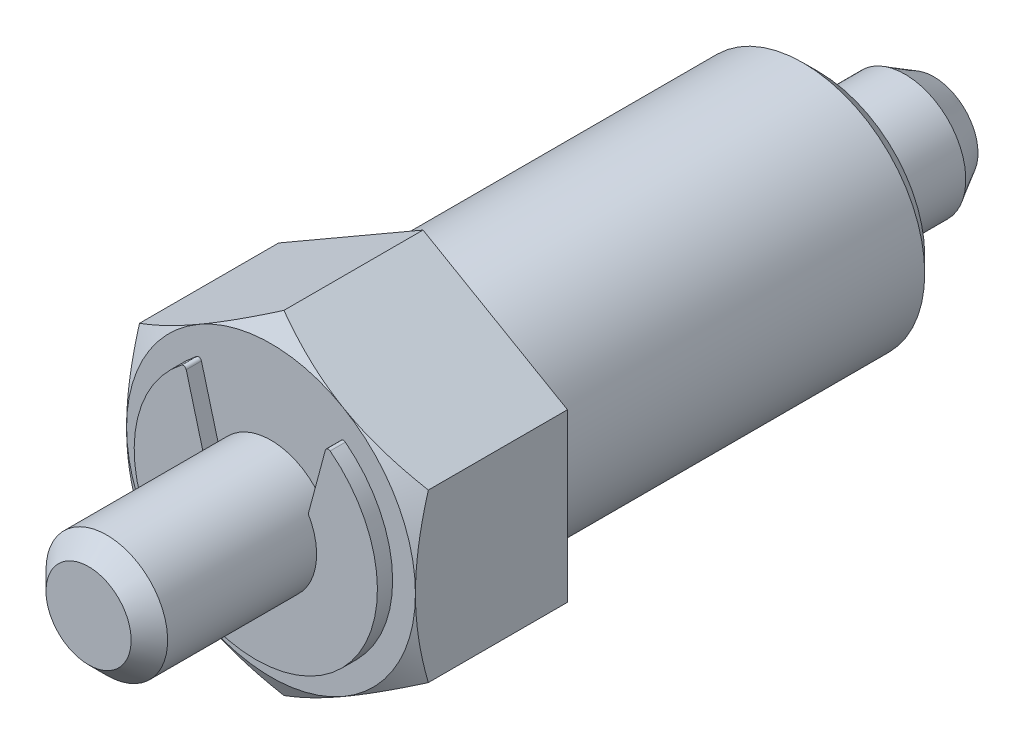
ISO-10303-21;
HEADER;
FILE_DESCRIPTION(('STEP AP214'),'2;1');
FILE_NAME('part.step','',(''),(''),'','','');
FILE_SCHEMA(('AUTOMOTIVE_DESIGN { 1 0 10303 214 1 1 1 1 }'));
ENDSEC;
DATA;
#1=APPLICATION_CONTEXT('core data for automotive mechanical design processes');
#2=APPLICATION_PROTOCOL_DEFINITION('international standard','automotive_design',2000,#1);
#3=PRODUCT_CONTEXT('',#1,'mechanical');
#4=PRODUCT('Part','Part','',(#3));
#5=PRODUCT_RELATED_PRODUCT_CATEGORY('part','',(#4));
#6=PRODUCT_DEFINITION_FORMATION('','',#4);
#7=PRODUCT_DEFINITION_CONTEXT('part definition',#1,'design');
#8=PRODUCT_DEFINITION('design','',#6,#7);
#9=PRODUCT_DEFINITION_SHAPE('','',#8);
#10=(LENGTH_UNIT() NAMED_UNIT(*) SI_UNIT(.MILLI.,.METRE.));
#11=(NAMED_UNIT(*) PLANE_ANGLE_UNIT() SI_UNIT($,.RADIAN.));
#12=(NAMED_UNIT(*) SI_UNIT($,.STERADIAN.) SOLID_ANGLE_UNIT());
#13=UNCERTAINTY_MEASURE_WITH_UNIT(LENGTH_MEASURE(1.E-05),#10,'distance_accuracy_value','');
#14=(GEOMETRIC_REPRESENTATION_CONTEXT(3) GLOBAL_UNCERTAINTY_ASSIGNED_CONTEXT((#13)) GLOBAL_UNIT_ASSIGNED_CONTEXT((#10,
#11,#12)) REPRESENTATION_CONTEXT('',''));
#15=CARTESIAN_POINT('',(0.,0.,0.));
#16=DIRECTION('',(0.,0.,1.));
#17=DIRECTION('',(1.,0.,0.));
#18=AXIS2_PLACEMENT_3D('',#15,#16,#17);
#19=CARTESIAN_POINT('',(-9.61399999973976,-9.69764665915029,10.0000000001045));
#20=DIRECTION('',(2.60239962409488E-11,-1.50249913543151E-11,1.));
#21=DIRECTION('',(1.,0.,-2.60239962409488E-11));
#22=AXIS2_PLACEMENT_3D('',#19,#20,#21);
#23=PLANE('',#22);
#24=CARTESIAN_POINT('',(2.60263999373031E-10,-1.50268686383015E-10,10.));
#25=DIRECTION('',(2.60239962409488E-11,-1.50249913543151E-11,1.));
#26=DIRECTION('',(1.,0.,-2.60239962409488E-11));
#27=AXIS2_PLACEMENT_3D('',#24,#25,#26);
#28=CIRCLE('',#27,9.50000539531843);
#29=CARTESIAN_POINT('',(9.50000269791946,-7.79397935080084E-08,10.0000015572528));
#30=VERTEX_POINT('',#29);
#31=CARTESIAN_POINT('',(4.75000121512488,8.22724374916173,10.000001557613));
#32=VERTEX_POINT('',#31);
#33=EDGE_CURVE('E621',#30,#32,#28,.T.);
#34=ORIENTED_EDGE('',*,*,#33,.T.);
#35=CARTESIAN_POINT('',(2.60263999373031E-10,-1.50268686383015E-10,10.));
#36=DIRECTION('',(2.60239962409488E-11,-1.50249913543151E-11,1.));
#37=DIRECTION('',(1.,0.,-2.60239962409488E-11));
#38=AXIS2_PLACEMENT_3D('',#35,#36,#37);
#39=CIRCLE('',#38,9.50000539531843);
#40=CARTESIAN_POINT('',(-4.75000147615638,8.22724359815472,10.0000015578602));
#41=VERTEX_POINT('',#40);
#42=EDGE_CURVE('E113',#32,#41,#39,.T.);
#43=ORIENTED_EDGE('',*,*,#42,.T.);
#44=CARTESIAN_POINT('',(2.60263999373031E-10,-1.50268686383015E-10,10.));
#45=DIRECTION('',(2.60239962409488E-11,-1.50249913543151E-11,1.));
#46=DIRECTION('',(1.,0.,-2.60239962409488E-11));
#47=AXIS2_PLACEMENT_3D('',#44,#45,#46);
#48=CIRCLE('',#47,9.50000539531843);
#49=CARTESIAN_POINT('',(-9.50000269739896,-3.97797905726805E-08,10.0000015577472));
#50=VERTEX_POINT('',#49);
#51=EDGE_CURVE('E97',#41,#50,#48,.T.);
#52=ORIENTED_EDGE('',*,*,#51,.T.);
#53=CARTESIAN_POINT('',(2.60263999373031E-10,-1.50268686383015E-10,10.));
#54=DIRECTION('',(2.60239962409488E-11,-1.50249913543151E-11,1.));
#55=DIRECTION('',(1.,0.,-2.60239962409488E-11));
#56=AXIS2_PLACEMENT_3D('',#53,#54,#55);
#57=CIRCLE('',#56,9.50000539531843);
#58=CARTESIAN_POINT('',(-4.7500012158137,-8.22724374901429,10.000001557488));
#59=VERTEX_POINT('',#58);
#60=EDGE_CURVE('E102',#50,#59,#57,.T.);
#61=ORIENTED_EDGE('',*,*,#60,.T.);
#62=CARTESIAN_POINT('',(2.60263999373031E-10,-1.50268686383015E-10,10.));
#63=DIRECTION('',(2.60239962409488E-11,-1.50249913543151E-11,1.));
#64=DIRECTION('',(1.,0.,-2.60239962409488E-11));
#65=AXIS2_PLACEMENT_3D('',#62,#63,#64);
#66=CIRCLE('',#65,9.50000539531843);
#67=CARTESIAN_POINT('',(4.75000147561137,-8.2272435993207,10.0000015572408));
#68=VERTEX_POINT('',#67);
#69=EDGE_CURVE('E107',#59,#68,#66,.T.);
#70=ORIENTED_EDGE('',*,*,#69,.T.);
#71=CARTESIAN_POINT('',(2.60263999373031E-10,-1.50268686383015E-10,10.));
#72=DIRECTION('',(2.60239962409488E-11,-1.50249913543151E-11,1.));
#73=DIRECTION('',(1.,0.,-2.60239962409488E-11));
#74=AXIS2_PLACEMENT_3D('',#71,#72,#73);
#75=CIRCLE('',#74,9.50000539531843);
#76=EDGE_CURVE('E623',#68,#30,#75,.T.);
#77=ORIENTED_EDGE('',*,*,#76,.T.);
#78=EDGE_LOOP('',(#34,#43,#52,#61,#70,#77));
#79=FACE_BOUND('',#78,.T.);
#80=CARTESIAN_POINT('',(2.60239962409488E-10,-1.50268686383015E-10,10.));
#81=DIRECTION('',(-2.60239962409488E-11,1.50249913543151E-11,-1.));
#82=DIRECTION('',(-1.,0.,2.60239962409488E-11));
#83=AXIS2_PLACEMENT_3D('',#80,#81,#82);
#84=CIRCLE('',#83,4.);
#85=CARTESIAN_POINT('',(3.45000000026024,2.02422824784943,9.99999999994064));
#86=VERTEX_POINT('',#85);
#87=CARTESIAN_POINT('',(-3.44999999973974,2.02422824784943,10.0000000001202));
#88=VERTEX_POINT('',#87);
#89=EDGE_CURVE('E10',#86,#88,#84,.F.);
#90=ORIENTED_EDGE('',*,*,#89,.F.);
#91=DIRECTION('',(-0.258819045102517,-0.965925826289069,-7.77752133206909E-12));
#92=VECTOR('',#91,1.);
#93=CARTESIAN_POINT('',(3.45000000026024,2.02422824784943,9.99999999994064));
#94=LINE('',#93,#92);
#95=CARTESIAN_POINT('',(4.57541189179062,6.22432260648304,9.99999999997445));
#96=VERTEX_POINT('',#95);
#97=EDGE_CURVE('E695',#96,#86,#94,.T.);
#98=ORIENTED_EDGE('',*,*,#97,.F.);
#99=CARTESIAN_POINT('',(4.76859705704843,6.17255879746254,9.99999999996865));
#100=DIRECTION('',(2.60239962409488E-11,-1.50249913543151E-11,1.));
#101=DIRECTION('',(1.,0.,-2.60239962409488E-11));
#102=AXIS2_PLACEMENT_3D('',#99,#100,#101);
#103=CIRCLE('',#102,0.200000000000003);
#104=CARTESIAN_POINT('',(4.89086877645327,6.33082953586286,9.99999999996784));
#105=VERTEX_POINT('',#104);
#106=EDGE_CURVE('E693',#105,#96,#103,.T.);
#107=ORIENTED_EDGE('',*,*,#106,.F.);
#108=CARTESIAN_POINT('',(2.60239962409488E-10,-1.50268686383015E-10,10.));
#109=DIRECTION('',(2.60239962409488E-11,-1.50249913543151E-11,1.));
#110=DIRECTION('',(1.,0.,-2.60239962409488E-11));
#111=AXIS2_PLACEMENT_3D('',#108,#109,#110);
#112=CIRCLE('',#111,7.99999999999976);
#113=CARTESIAN_POINT('',(-4.89086877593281,6.33082953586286,10.0000000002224));
#114=VERTEX_POINT('',#113);
#115=EDGE_CURVE('E518',#114,#105,#112,.T.);
#116=ORIENTED_EDGE('',*,*,#115,.F.);
#117=CARTESIAN_POINT('',(-4.76859705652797,6.17255879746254,10.0000000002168));
#118=DIRECTION('',(2.60239962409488E-11,-1.50249913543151E-11,1.));
#119=DIRECTION('',(1.,0.,-2.60239962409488E-11));
#120=AXIS2_PLACEMENT_3D('',#117,#118,#119);
#121=CIRCLE('',#120,0.200000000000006);
#122=CARTESIAN_POINT('',(-4.57541189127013,6.22432260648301,10.0000000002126));
#123=VERTEX_POINT('',#122);
#124=EDGE_CURVE('E511',#123,#114,#121,.T.);
#125=ORIENTED_EDGE('',*,*,#124,.F.);
#126=DIRECTION('',(-0.258819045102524,0.965925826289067,2.12485330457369E-11));
#127=VECTOR('',#126,1.);
#128=CARTESIAN_POINT('',(-3.44999999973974,2.02422824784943,10.0000000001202));
#129=LINE('',#128,#127);
#130=EDGE_CURVE('E688',#88,#123,#129,.T.);
#131=ORIENTED_EDGE('',*,*,#130,.F.);
#132=EDGE_LOOP('',(#90,#98,#107,#116,#125,#131));
#133=FACE_BOUND('',#132,.T.);
#134=ADVANCED_FACE('F16',(#79,#133),#23,.T.);
#135=CARTESIAN_POINT('',(5.41299121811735E-10,-3.12527781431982E-10,20.8));
#136=DIRECTION('',(-2.60239962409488E-11,1.50249913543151E-11,-1.));
#137=DIRECTION('',(-1.,0.,2.60239962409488E-11));
#138=AXIS2_PLACEMENT_3D('',#135,#136,#137);
#139=CYLINDRICAL_SURFACE('',#138,4.);
#140=CARTESIAN_POINT('',(5.41299121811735E-10,-3.12527781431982E-10,20.8));
#141=DIRECTION('',(-2.60239962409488E-11,1.50249913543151E-11,-1.));
#142=DIRECTION('',(-1.,0.,2.60239962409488E-11));
#143=AXIS2_PLACEMENT_3D('',#140,#141,#142);
#144=CIRCLE('',#143,4.);
#145=CARTESIAN_POINT('',(-3.9999999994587,-3.12527781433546E-10,20.8000000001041));
#146=VERTEX_POINT('',#145);
#147=EDGE_CURVE('E24',#146,#146,#144,.T.);
#148=ORIENTED_EDGE('',*,*,#147,.T.);
#149=EDGE_LOOP('',(#148));
#150=FACE_BOUND('',#149,.T.);
#151=DIRECTION('',(-2.60239962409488E-11,1.50249913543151E-11,-1.));
#152=VECTOR('',#151,1.);
#153=CARTESIAN_POINT('',(3.45000000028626,2.02422824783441,10.9999999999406));
#154=LINE('',#153,#152);
#155=CARTESIAN_POINT('',(3.45000000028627,2.02422824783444,10.9999999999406));
#156=VERTEX_POINT('',#155);
#157=EDGE_CURVE('E32',#156,#86,#154,.T.);
#158=ORIENTED_EDGE('',*,*,#157,.T.);
#159=ORIENTED_EDGE('',*,*,#89,.T.);
#160=DIRECTION('',(-2.60239962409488E-11,1.50249913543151E-11,-1.));
#161=VECTOR('',#160,1.);
#162=CARTESIAN_POINT('',(-3.44999999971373,2.02422824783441,11.0000000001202));
#163=LINE('',#162,#161);
#164=CARTESIAN_POINT('',(-3.44999999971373,2.02422824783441,11.0000000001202));
#165=VERTEX_POINT('',#164);
#166=EDGE_CURVE('E703',#165,#88,#163,.T.);
#167=ORIENTED_EDGE('',*,*,#166,.F.);
#168=CARTESIAN_POINT('',(2.86263958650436E-10,-1.6528445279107E-10,11.));
#169=DIRECTION('',(-2.60239962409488E-11,1.50249913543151E-11,-1.));
#170=DIRECTION('',(1.,0.,-2.60239962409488E-11));
#171=AXIS2_PLACEMENT_3D('',#168,#169,#170);
#172=CIRCLE('',#171,4.);
#173=EDGE_CURVE('E708',#156,#165,#172,.T.);
#174=ORIENTED_EDGE('',*,*,#173,.F.);
#175=EDGE_LOOP('',(#158,#159,#167,#174));
#176=FACE_BOUND('',#175,.T.);
#177=ADVANCED_FACE('F151',(#150,#176),#139,.T.);
#178=CARTESIAN_POINT('',(-8.8481587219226E-10,5.1084136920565E-10,-34.));
#179=CARTESIAN_POINT('',(-8.8481587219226E-10,5.10883002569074E-10,-34.0000000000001));
#180=CARTESIAN_POINT('',(-8.8481587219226E-10,5.10883002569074E-10,-34.0000000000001));
#181=CARTESIAN_POINT('',(-8.8481587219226E-10,5.1084136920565E-10,-34.));
#182=CARTESIAN_POINT('',(-0.990944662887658,5.124416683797E-10,-34.1092183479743));
#183=CARTESIAN_POINT('',(-0.99094466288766,1.98188932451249,-34.1092183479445));
#184=CARTESIAN_POINT('',(0.990944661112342,1.98188932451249,-34.1092183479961));
#185=CARTESIAN_POINT('',(0.990944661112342,5.124416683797E-10,-34.1092183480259));
#186=CARTESIAN_POINT('',(-1.97855869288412,5.10402099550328E-10,-33.9731356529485));
#187=CARTESIAN_POINT('',(-1.97855869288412,3.95711738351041,-33.9731356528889));
#188=CARTESIAN_POINT('',(1.97855869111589,3.95711738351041,-33.9731356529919));
#189=CARTESIAN_POINT('',(1.97855869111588,5.10402099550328E-10,-33.9731356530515));
#190=CARTESIAN_POINT('',(-2.90303902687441,5.04818409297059E-10,-33.5999921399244));
#191=CARTESIAN_POINT('',(-2.90303902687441,5.80607805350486,-33.5999921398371));
#192=CARTESIAN_POINT('',(2.90303902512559,5.80607805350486,-33.5999921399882));
#193=CARTESIAN_POINT('',(2.90303902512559,5.04818409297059E-10,-33.5999921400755));
#194=(BOUNDED_SURFACE() B_SPLINE_SURFACE(3,3,((#178,#179,#180,#181),(#182,#183,#184,#185),(#186,
#187,#188,#189),(#190,#191,#192,#193)),.UNSPECIFIED.,.F.,.F.,
.F.) B_SPLINE_SURFACE_WITH_KNOTS((4,4),(4,4),(0.,1.),(0.,1.),
.UNSPECIFIED.) GEOMETRIC_REPRESENTATION_ITEM() RATIONAL_B_SPLINE_SURFACE(((1.,0.333333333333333,
0.333333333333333,1.),(0.979815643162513,0.326605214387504,0.326605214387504,0.979815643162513),
(0.979815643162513,0.326605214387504,0.326605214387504,0.979815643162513),(1.,0.333333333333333,
0.333333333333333,1.))) REPRESENTATION_ITEM('') SURFACE());
#195=CARTESIAN_POINT('',(-8.8481587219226E-10,5.1084136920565E-10,-34.));
#196=CARTESIAN_POINT('',(0.990944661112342,5.124416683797E-10,-34.1092183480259));
#197=CARTESIAN_POINT('',(1.97855869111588,5.10402099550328E-10,-33.9731356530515));
#198=CARTESIAN_POINT('',(2.90303902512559,5.04818409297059E-10,-33.5999921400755));
#199=(BOUNDED_CURVE() B_SPLINE_CURVE(3,(#195,#196,#197,#198),.UNSPECIFIED.,.F.,
.F.) B_SPLINE_CURVE_WITH_KNOTS((4,4),(0.,1.),
.UNSPECIFIED.) CURVE() GEOMETRIC_REPRESENTATION_ITEM() RATIONAL_B_SPLINE_CURVE((1.,
0.979815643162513,0.979815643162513,1.)) REPRESENTATION_ITEM(''));
#200=CARTESIAN_POINT('',(-8.8481587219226E-10,5.1084136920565E-10,-34.));
#201=VERTEX_POINT('',#200);
#202=CARTESIAN_POINT('',(2.90303902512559,1.13797860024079E-10,-33.5999921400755));
#203=VERTEX_POINT('',#202);
#204=EDGE_CURVE('E521',#201,#203,#199,.T.);
#205=CARTESIAN_POINT('',(-8.8481587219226E-10,5.1084136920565E-10,-34.));
#206=CARTESIAN_POINT('',(-0.990944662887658,5.124416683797E-10,-34.1092183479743));
#207=CARTESIAN_POINT('',(-1.97855869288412,5.10402099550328E-10,-33.9731356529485));
#208=CARTESIAN_POINT('',(-2.90303902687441,5.04818409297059E-10,-33.5999921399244));
#209=(BOUNDED_CURVE() B_SPLINE_CURVE(3,(#205,#206,#207,#208),.UNSPECIFIED.,.F.,
.F.) B_SPLINE_CURVE_WITH_KNOTS((4,4),(0.,1.),
.UNSPECIFIED.) CURVE() GEOMETRIC_REPRESENTATION_ITEM() RATIONAL_B_SPLINE_CURVE((1.,
0.979815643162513,0.979815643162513,1.)) REPRESENTATION_ITEM(''));
#210=CARTESIAN_POINT('',(-2.90303902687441,-3.88189480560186E-10,-33.5999921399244));
#211=VERTEX_POINT('',#210);
#212=EDGE_CURVE('E525',#211,#201,#209,.F.);
#213=CARTESIAN_POINT('',(-8.74406069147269E-10,5.04818409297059E-10,-33.59999214));
#214=DIRECTION('',(2.60239962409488E-11,-1.50249913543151E-11,1.));
#215=DIRECTION('',(1.,0.,-2.60144353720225E-11));
#216=AXIS2_PLACEMENT_3D('',#213,#214,#215);
#217=CIRCLE('',#216,2.903039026);
#218=EDGE_CURVE('E595',#203,#211,#217,.T.);
#219=ORIENTED_EDGE('',*,*,#204,.F.);
#220=ORIENTED_EDGE('',*,*,#212,.F.);
#221=ORIENTED_EDGE('',*,*,#218,.F.);
#222=EDGE_LOOP('',(#219,#220,#221));
#223=FACE_BOUND('',#222,.T.);
#224=ADVANCED_FACE('F154',(#223),#194,.T.);
#225=CARTESIAN_POINT('',(-8.8481587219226E-10,5.1084136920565E-10,-34.));
#226=CARTESIAN_POINT('',(-8.8481587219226E-10,5.10883002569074E-10,-34.0000000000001));
#227=CARTESIAN_POINT('',(-8.8481587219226E-10,5.10883002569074E-10,-34.0000000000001));
#228=CARTESIAN_POINT('',(-8.8481587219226E-10,5.1084136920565E-10,-34.));
#229=CARTESIAN_POINT('',(0.990944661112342,5.124416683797E-10,-34.1092183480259));
#230=CARTESIAN_POINT('',(0.990944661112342,-1.98188932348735,-34.1092183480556));
#231=CARTESIAN_POINT('',(-0.99094466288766,-1.98188932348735,-34.1092183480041));
#232=CARTESIAN_POINT('',(-0.990944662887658,5.124416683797E-10,-34.1092183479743));
#233=CARTESIAN_POINT('',(1.97855869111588,5.10402099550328E-10,-33.9731356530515));
#234=CARTESIAN_POINT('',(1.97855869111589,-3.95711738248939,-33.9731356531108));
#235=CARTESIAN_POINT('',(-1.97855869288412,-3.95711738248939,-33.9731356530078));
#236=CARTESIAN_POINT('',(-1.97855869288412,5.10402099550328E-10,-33.9731356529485));
#237=CARTESIAN_POINT('',(2.90303902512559,5.04818409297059E-10,-33.5999921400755));
#238=CARTESIAN_POINT('',(2.90303902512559,-5.80607805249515,-33.5999921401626));
#239=CARTESIAN_POINT('',(-2.90303902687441,-5.80607805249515,-33.5999921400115));
#240=CARTESIAN_POINT('',(-2.90303902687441,5.04818409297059E-10,-33.5999921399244));
#241=(BOUNDED_SURFACE() B_SPLINE_SURFACE(3,3,((#225,#226,#227,#228),(#229,#230,#231,#232),(#233,
#234,#235,#236),(#237,#238,#239,#240)),.UNSPECIFIED.,.F.,.F.,
.F.) B_SPLINE_SURFACE_WITH_KNOTS((4,4),(4,4),(0.,1.),(0.,1.),
.UNSPECIFIED.) GEOMETRIC_REPRESENTATION_ITEM() RATIONAL_B_SPLINE_SURFACE(((1.,0.333333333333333,
0.333333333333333,1.),(0.979815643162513,0.326605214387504,0.326605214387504,0.979815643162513),
(0.979815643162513,0.326605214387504,0.326605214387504,0.979815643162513),(1.,0.333333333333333,
0.333333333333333,1.))) REPRESENTATION_ITEM('') SURFACE());
#242=CARTESIAN_POINT('',(-8.74406069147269E-10,5.04818409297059E-10,-33.59999214));
#243=DIRECTION('',(2.60239962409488E-11,-1.50249913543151E-11,1.));
#244=DIRECTION('',(1.,0.,-2.60144353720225E-11));
#245=AXIS2_PLACEMENT_3D('',#242,#243,#244);
#246=CIRCLE('',#245,2.903039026);
#247=EDGE_CURVE('E594',#211,#203,#246,.T.);
#248=ORIENTED_EDGE('',*,*,#247,.F.);
#249=ORIENTED_EDGE('',*,*,#212,.T.);
#250=ORIENTED_EDGE('',*,*,#204,.T.);
#251=EDGE_LOOP('',(#248,#249,#250));
#252=FACE_BOUND('',#251,.T.);
#253=ADVANCED_FACE('F284',(#252),#241,.T.);
#254=CARTESIAN_POINT('',(-8.74406069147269E-10,5.04818409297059E-10,-33.59999214));
#255=DIRECTION('',(2.60239962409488E-11,-1.50249913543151E-11,1.));
#256=DIRECTION('',(1.,0.,-2.60239962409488E-11));
#257=AXIS2_PLACEMENT_3D('',#254,#255,#256);
#258=CONICAL_SURFACE('',#257,2.903039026,0.523598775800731);
#259=ORIENTED_EDGE('',*,*,#218,.T.);
#260=ORIENTED_EDGE('',*,*,#247,.T.);
#261=EDGE_LOOP('',(#259,#260));
#262=FACE_BOUND('',#261,.T.);
#263=CARTESIAN_POINT('',(-8.24960680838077E-10,4.76285677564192E-10,-31.7));
#264=DIRECTION('',(-2.60239962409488E-11,1.50249913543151E-11,-1.));
#265=DIRECTION('',(-1.,0.,2.60239962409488E-11));
#266=AXIS2_PLACEMENT_3D('',#263,#264,#265);
#267=CIRCLE('',#266,4.);
#268=CARTESIAN_POINT('',(-4.00000000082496,4.76285677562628E-10,-31.6999999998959));
#269=VERTEX_POINT('',#268);
#270=EDGE_CURVE('E591',#269,#269,#267,.F.);
#271=ORIENTED_EDGE('',*,*,#270,.F.);
#272=EDGE_LOOP('',(#271));
#273=FACE_BOUND('',#272,.T.);
#274=ADVANCED_FACE('F293',(#262,#273),#258,.T.);
#275=CARTESIAN_POINT('',(-6.76623902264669E-10,3.90631971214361E-10,-26.));
#276=DIRECTION('',(-2.60239962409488E-11,1.50249913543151E-11,-1.));
#277=DIRECTION('',(-1.,0.,2.60239962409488E-11));
#278=AXIS2_PLACEMENT_3D('',#275,#276,#277);
#279=CYLINDRICAL_SURFACE('',#278,4.);
#280=CARTESIAN_POINT('',(-6.76623902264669E-10,3.90631971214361E-10,-26.));
#281=DIRECTION('',(-2.60239962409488E-11,1.50249913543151E-11,-1.));
#282=DIRECTION('',(-1.,0.,2.60239962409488E-11));
#283=AXIS2_PLACEMENT_3D('',#280,#281,#282);
#284=CIRCLE('',#283,4.);
#285=CARTESIAN_POINT('',(-4.00000000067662,3.90631971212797E-10,-25.9999999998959));
#286=VERTEX_POINT('',#285);
#287=EDGE_CURVE('E19',#286,#286,#284,.F.);
#288=ORIENTED_EDGE('',*,*,#287,.F.);
#289=EDGE_LOOP('',(#288));
#290=FACE_BOUND('',#289,.T.);
#291=ORIENTED_EDGE('',*,*,#270,.T.);
#292=EDGE_LOOP('',(#291));
#293=FACE_BOUND('',#292,.T.);
#294=ADVANCED_FACE('F160',(#290,#293),#279,.T.);
#295=CARTESIAN_POINT('',(7.08399999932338,-7.10837582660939,-26.0000000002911));
#296=DIRECTION('',(-2.60239962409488E-11,1.50249913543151E-11,-1.));
#297=DIRECTION('',(-1.,0.,2.60239962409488E-11));
#298=AXIS2_PLACEMENT_3D('',#295,#296,#297);
#299=PLANE('',#298);
#300=ORIENTED_EDGE('',*,*,#287,.T.);
#301=EDGE_LOOP('',(#300));
#302=FACE_BOUND('',#301,.T.);
#303=CARTESIAN_POINT('',(-6.76623902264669E-10,3.90631971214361E-10,-26.));
#304=DIRECTION('',(2.60239962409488E-11,-1.50249913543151E-11,1.));
#305=DIRECTION('',(1.,0.,-2.60239962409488E-11));
#306=AXIS2_PLACEMENT_3D('',#303,#304,#305);
#307=CIRCLE('',#306,7.);
#308=CARTESIAN_POINT('',(6.99999999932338,3.90631971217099E-10,-26.0000000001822));
#309=VERTEX_POINT('',#308);
#310=EDGE_CURVE('E590',#309,#309,#307,.T.);
#311=ORIENTED_EDGE('',*,*,#310,.F.);
#312=EDGE_LOOP('',(#311));
#313=FACE_BOUND('',#312,.T.);
#314=ADVANCED_FACE('F156',(#302,#313),#299,.T.);
#315=CARTESIAN_POINT('',(-6.76623902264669E-10,3.90631971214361E-10,-26.));
#316=DIRECTION('',(2.60239962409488E-11,-1.50249913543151E-11,1.));
#317=DIRECTION('',(1.,0.,-2.60239962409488E-11));
#318=AXIS2_PLACEMENT_3D('',#315,#316,#317);
#319=CONICAL_SURFACE('',#318,7.,0.785398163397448);
#320=ORIENTED_EDGE('',*,*,#310,.T.);
#321=EDGE_LOOP('',(#320));
#322=FACE_BOUND('',#321,.T.);
#323=CARTESIAN_POINT('',(-6.5059990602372E-10,3.75616204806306E-10,-25.));
#324=DIRECTION('',(-2.60239962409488E-11,1.50249913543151E-11,-1.));
#325=DIRECTION('',(-1.,0.,2.60239962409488E-11));
#326=AXIS2_PLACEMENT_3D('',#323,#324,#325);
#327=CIRCLE('',#326,8.);
#328=CARTESIAN_POINT('',(-8.0000000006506,3.75616204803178E-10,-24.9999999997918));
#329=VERTEX_POINT('',#328);
#330=EDGE_CURVE('E587',#329,#329,#327,.F.);
#331=ORIENTED_EDGE('',*,*,#330,.F.);
#332=EDGE_LOOP('',(#331));
#333=FACE_BOUND('',#332,.T.);
#334=ADVANCED_FACE('F159',(#322,#333),#319,.T.);
#335=CARTESIAN_POINT('',(0.,0.,0.));
#336=DIRECTION('',(-2.60239962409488E-11,1.50249913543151E-11,-1.));
#337=DIRECTION('',(-1.,0.,2.60239962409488E-11));
#338=AXIS2_PLACEMENT_3D('',#335,#336,#337);
#339=CYLINDRICAL_SURFACE('',#338,8.);
#340=CARTESIAN_POINT('',(0.,0.,0.));
#341=DIRECTION('',(-2.60239962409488E-11,1.50249913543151E-11,-1.));
#342=DIRECTION('',(-1.,0.,2.60239962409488E-11));
#343=AXIS2_PLACEMENT_3D('',#340,#341,#342);
#344=CIRCLE('',#343,8.);
#345=CARTESIAN_POINT('',(-8.,0.,2.0819196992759E-10));
#346=VERTEX_POINT('',#345);
#347=EDGE_CURVE('E191',#346,#346,#344,.F.);
#348=ORIENTED_EDGE('',*,*,#347,.F.);
#349=EDGE_LOOP('',(#348));
#350=FACE_BOUND('',#349,.T.);
#351=ORIENTED_EDGE('',*,*,#330,.T.);
#352=EDGE_LOOP('',(#351));
#353=FACE_BOUND('',#352,.T.);
#354=ADVANCED_FACE('F165',(#350,#353),#339,.T.);
#355=CARTESIAN_POINT('',(9.5,-11.101290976,-4.14029921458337E-10));
#356=DIRECTION('',(-2.60239962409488E-11,1.50249913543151E-11,-1.));
#357=DIRECTION('',(-1.,0.,2.60239962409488E-11));
#358=AXIS2_PLACEMENT_3D('',#355,#356,#357);
#359=PLANE('',#358);
#360=ORIENTED_EDGE('',*,*,#347,.T.);
#361=EDGE_LOOP('',(#360));
#362=FACE_BOUND('',#361,.T.);
#363=DIRECTION('',(0.,1.,1.50249913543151E-11));
#364=VECTOR('',#363,1.);
#365=CARTESIAN_POINT('',(9.5,0.,-2.47218912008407E-10));
#366=LINE('',#365,#364);
#367=CARTESIAN_POINT('',(9.5,-5.48482755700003,-3.29652971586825E-10));
#368=VERTEX_POINT('',#367);
#369=CARTESIAN_POINT('',(9.5,5.48482755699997,-1.64812608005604E-10));
#370=VERTEX_POINT('',#369);
#371=EDGE_CURVE('E545',#368,#370,#366,.T.);
#372=ORIENTED_EDGE('',*,*,#371,.F.);
#373=DIRECTION('',(0.866025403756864,0.500000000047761,-1.50249461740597E-11));
#374=VECTOR('',#373,1.);
#375=CARTESIAN_POINT('',(4.75,-8.22724133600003,-2.47218912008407E-10));
#376=LINE('',#375,#374);
#377=CARTESIAN_POINT('',(0.,-10.969655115,-1.64812608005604E-10));
#378=VERTEX_POINT('',#377);
#379=EDGE_CURVE('E539',#378,#368,#376,.T.);
#380=ORIENTED_EDGE('',*,*,#379,.F.);
#381=DIRECTION('',(0.866025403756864,-0.500000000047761,-3.00499375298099E-11));
#382=VECTOR('',#381,1.);
#383=CARTESIAN_POINT('',(-4.75,-8.22724133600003,0.));
#384=LINE('',#383,#382);
#385=CARTESIAN_POINT('',(-9.5,-5.48482756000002,1.64812608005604E-10));
#386=VERTEX_POINT('',#385);
#387=EDGE_CURVE('E532',#386,#378,#384,.T.);
#388=ORIENTED_EDGE('',*,*,#387,.F.);
#389=DIRECTION('',(0.,-1.,-1.50249913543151E-11));
#390=VECTOR('',#389,1.);
#391=CARTESIAN_POINT('',(-9.5,-4.50001147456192E-09,2.47218912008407E-10));
#392=LINE('',#391,#390);
#393=CARTESIAN_POINT('',(-9.5,5.48482755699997,3.29625216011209E-10));
#394=VERTEX_POINT('',#393);
#395=EDGE_CURVE('E533',#394,#386,#392,.T.);
#396=ORIENTED_EDGE('',*,*,#395,.F.);
#397=DIRECTION('',(-0.866025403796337,-0.499999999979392,1.50249461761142E-11));
#398=VECTOR('',#397,1.);
#399=CARTESIAN_POINT('',(-4.75,8.22724133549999,2.47218912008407E-10));
#400=LINE('',#399,#398);
#401=CARTESIAN_POINT('',(0.,10.969655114,1.64812608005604E-10));
#402=VERTEX_POINT('',#401);
#403=EDGE_CURVE('E551',#402,#394,#400,.T.);
#404=ORIENTED_EDGE('',*,*,#403,.F.);
#405=DIRECTION('',(-0.866025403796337,0.499999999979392,3.00499375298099E-11));
#406=VECTOR('',#405,1.);
#407=CARTESIAN_POINT('',(4.75,8.22724133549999,0.));
#408=LINE('',#407,#406);
#409=EDGE_CURVE('E555',#370,#402,#408,.T.);
#410=ORIENTED_EDGE('',*,*,#409,.F.);
#411=EDGE_LOOP('',(#372,#380,#388,#396,#404,#410));
#412=FACE_BOUND('',#411,.T.);
#413=ADVANCED_FACE('F162',(#362,#412),#359,.T.);
#414=CARTESIAN_POINT('',(-9.5,-5.48482756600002,1.64812608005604E-10));
#415=DIRECTION('',(-1.,0.,2.60239962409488E-11));
#416=DIRECTION('',(2.60239962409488E-11,-1.50249913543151E-11,1.));
#417=AXIS2_PLACEMENT_3D('',#414,#415,#416);
#418=PLANE('',#417);
#419=ORIENTED_EDGE('',*,*,#395,.T.);
#420=DIRECTION('',(-2.60239962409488E-11,1.50249913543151E-11,-1.));
#421=VECTOR('',#420,1.);
#422=CARTESIAN_POINT('',(-9.4999999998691,-5.48482755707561,5.03000000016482));
#423=LINE('',#422,#421);
#424=CARTESIAN_POINT('',(-9.50000000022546,-5.48482755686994,9.1514942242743));
#425=VERTEX_POINT('',#424);
#426=EDGE_CURVE('E85',#425,#386,#423,.T.);
#427=ORIENTED_EDGE('',*,*,#426,.F.);
#428=CARTESIAN_POINT('',(-9.49999999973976,-3.97797905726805E-08,10.0000031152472));
#429=CARTESIAN_POINT('',(-9.49999999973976,-0.232800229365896,10.0000419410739));
#430=CARTESIAN_POINT('',(-9.49999999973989,-0.465589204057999,9.99506349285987));
#431=CARTESIAN_POINT('',(-9.4999999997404,-0.930710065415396,9.97536062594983));
#432=CARTESIAN_POINT('',(-9.49999999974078,-1.16304203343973,9.96063813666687));
#433=CARTESIAN_POINT('',(-9.49999999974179,-1.62574819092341,9.92183271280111));
#434=CARTESIAN_POINT('',(-9.49999999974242,-1.85612636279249,9.89779690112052));
#435=CARTESIAN_POINT('',(-9.4999999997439,-2.31578509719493,9.84088185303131));
#436=CARTESIAN_POINT('',(-9.49999999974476,-2.5450656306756,9.80800238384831));
#437=CARTESIAN_POINT('',(-9.49999999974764,-3.23031037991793,9.69711422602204));
#438=CARTESIAN_POINT('',(-9.49999999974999,-3.68428391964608,9.60680194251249));
#439=CARTESIAN_POINT('',(-9.49999999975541,-4.58832699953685,9.39851872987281));
#440=CARTESIAN_POINT('',(-9.49999999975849,-5.03836500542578,9.28040966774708));
#441=CARTESIAN_POINT('',(-9.49999999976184,-5.48482755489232,9.1514942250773));
#442=B_SPLINE_CURVE_WITH_KNOTS('',3,(#428,#429,#430,#431,#432,#433,#434,#435,#436,#437,#438,
#439,#440,#441),.UNSPECIFIED.,.F.,.F.,(4,2,2,2,2,2,4),(0.,0.69832929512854,1.3965203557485,
2.09122394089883,2.78594581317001,4.173568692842,5.56823850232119),.UNSPECIFIED.);
#443=EDGE_CURVE('E77',#50,#425,#442,.T.);
#444=ORIENTED_EDGE('',*,*,#443,.F.);
#445=CARTESIAN_POINT('',(-9.50000000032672,5.48482755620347,9.15149422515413));
#446=CARTESIAN_POINT('',(-9.4999999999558,5.03836500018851,9.2804096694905));
#447=CARTESIAN_POINT('',(-9.49999999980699,4.58832698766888,9.39851873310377));
#448=CARTESIAN_POINT('',(-9.49999999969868,3.68428389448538,9.60680194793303));
#449=CARTESIAN_POINT('',(-9.49999999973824,3.230310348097,9.69711423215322));
#450=CARTESIAN_POINT('',(-9.49999999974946,2.5450655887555,9.80800239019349));
#451=CARTESIAN_POINT('',(-9.49999999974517,2.31578505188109,9.84088185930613));
#452=CARTESIAN_POINT('',(-9.49999999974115,1.85612631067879,9.89779690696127));
#453=CARTESIAN_POINT('',(-9.49999999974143,1.62574813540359,9.92183271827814));
#454=CARTESIAN_POINT('',(-9.49999999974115,1.16304197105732,9.96063814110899));
#455=CARTESIAN_POINT('',(-9.49999999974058,0.930709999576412,9.97536062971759));
#456=CARTESIAN_POINT('',(-9.49999999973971,0.465589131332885,9.99506349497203));
#457=CARTESIAN_POINT('',(-9.49999999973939,0.232800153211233,10.0000419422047));
#458=CARTESIAN_POINT('',(-9.49999999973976,-3.97797905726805E-08,10.0000031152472));
#459=B_SPLINE_CURVE_WITH_KNOTS('',3,(#445,#446,#447,#448,#449,#450,#451,#452,#453,#454,#455,
#456,#457,#458),.UNSPECIFIED.,.F.,.F.,(4,2,2,2,2,2,4),(0.,1.39466982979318,2.78229272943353,
3.47701461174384,4.17171820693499,4.86990927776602,5.56823858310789),.UNSPECIFIED.);
#460=CARTESIAN_POINT('',(-9.49999999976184,5.48482755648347,9.1514942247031));
#461=VERTEX_POINT('',#460);
#462=EDGE_CURVE('E82',#461,#50,#459,.T.);
#463=ORIENTED_EDGE('',*,*,#462,.F.);
#464=DIRECTION('',(2.60239962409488E-11,-1.50249913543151E-11,1.));
#465=VECTOR('',#464,1.);
#466=CARTESIAN_POINT('',(-9.4999999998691,5.48482755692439,5.03000000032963));
#467=LINE('',#466,#465);
#468=EDGE_CURVE('E548',#394,#461,#467,.T.);
#469=ORIENTED_EDGE('',*,*,#468,.F.);
#470=EDGE_LOOP('',(#419,#427,#444,#463,#469));
#471=FACE_BOUND('',#470,.T.);
#472=ADVANCED_FACE('F80',(#471),#418,.T.);
#473=CARTESIAN_POINT('',(-9.5,-5.48482755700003,1.64812608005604E-10));
#474=DIRECTION('',(-0.500000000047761,-0.866025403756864,0.));
#475=DIRECTION('',(0.866025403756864,-0.500000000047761,-3.00499375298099E-11));
#476=AXIS2_PLACEMENT_3D('',#473,#474,#475);
#477=PLANE('',#476);
#478=ORIENTED_EDGE('',*,*,#387,.T.);
#479=DIRECTION('',(-2.60239962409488E-11,1.50249913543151E-11,-1.));
#480=VECTOR('',#479,1.);
#481=CARTESIAN_POINT('',(1.30900701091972E-10,-10.9696551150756,5.02999999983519));
#482=LINE('',#481,#480);
#483=CARTESIAN_POINT('',(5.33381313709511E-10,-10.9696551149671,9.1514942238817));
#484=VERTEX_POINT('',#483);
#485=EDGE_CURVE('E536',#484,#378,#482,.T.);
#486=ORIENTED_EDGE('',*,*,#485,.F.);
#487=CARTESIAN_POINT('',(-4.75000053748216,-8.2272425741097,10.000003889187));
#488=CARTESIAN_POINT('',(-4.54838925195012,-8.34364191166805,10.0000422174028));
#489=CARTESIAN_POINT('',(-4.34678792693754,-8.46003608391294,9.99506356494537));
#490=CARTESIAN_POINT('',(-3.94398134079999,-8.69259627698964,9.97536054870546));
#491=CARTESIAN_POINT('',(-3.74277600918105,-8.80876233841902,9.96063811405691));
#492=CARTESIAN_POINT('',(-3.34206076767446,-9.04011547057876,9.92183273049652));
#493=CARTESIAN_POINT('',(-3.14254740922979,-9.15530453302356,9.89779690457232));
#494=CARTESIAN_POINT('',(-2.74447126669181,-9.38513387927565,9.84088184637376));
#495=CARTESIAN_POINT('',(-2.54590850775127,-9.49977414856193,9.8080023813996));
#496=CARTESIAN_POINT('',(-1.95246915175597,-9.84239653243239,9.69711422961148));
#497=CARTESIAN_POINT('',(-1.55931652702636,-10.0693833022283,9.60680194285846));
#498=CARTESIAN_POINT('',(-0.776392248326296,-10.5214048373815,9.39851872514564));
#499=CARTESIAN_POINT('',(-0.386647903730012,-10.746423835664,9.28040966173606));
#500=CARTESIAN_POINT('',(-2.81217840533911E-10,-10.9696551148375,9.1514942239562));
#501=B_SPLINE_CURVE_WITH_KNOTS('',3,(#487,#488,#489,#490,#491,#492,#493,#494,#495,#496,#497,
#498,#499,#500),.UNSPECIFIED.,.F.,.F.,(4,2,2,2,2,2,4),(0.,0.698329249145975,1.39652028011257,
2.09122385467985,2.78594571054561,4.17356860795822,5.56823840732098),.UNSPECIFIED.);
#502=EDGE_CURVE('E216',#59,#484,#501,.T.);
#503=ORIENTED_EDGE('',*,*,#502,.F.);
#504=CARTESIAN_POINT('',(-9.50000000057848,-5.48482755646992,9.15149422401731));
#505=CARTESIAN_POINT('',(-9.20979294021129,-5.65237868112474,9.24821894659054));
#506=CARTESIAN_POINT('',(-8.91796517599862,-5.82086551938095,9.33886130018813));
#507=CARTESIAN_POINT('',(-8.33087862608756,-6.15982009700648,9.50562308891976));
#508=CARTESIAN_POINT('',(-8.03561633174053,-6.33028986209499,9.58172597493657));
#509=CARTESIAN_POINT('',(-7.44461463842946,-6.6715048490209,9.7162547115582));
#510=CARTESIAN_POINT('',(-7.14889996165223,-6.84223579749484,9.77482331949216));
#511=CARTESIAN_POINT('',(-6.55522322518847,-7.18499522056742,9.87279035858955));
#512=CARTESIAN_POINT('',(-6.25726250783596,-7.35702292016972,9.91219944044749));
#513=CARTESIAN_POINT('',(-5.75787019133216,-7.64534720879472,9.9605854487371));
#514=CARTESIAN_POINT('',(-5.55684824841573,-7.76140728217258,9.97530504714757));
#515=CARTESIAN_POINT('',(-5.15389094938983,-7.99405478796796,9.99504534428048));
#516=CARTESIAN_POINT('',(-4.95195460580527,-8.11064279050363,10.0000390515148));
#517=CARTESIAN_POINT('',(-4.74999981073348,-8.22724144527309,10.000003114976));
#518=B_SPLINE_CURVE_WITH_KNOTS('',3,(#504,#505,#506,#507,#508,#509,#510,#511,#512,#513,#514,
#515,#516,#517),.UNSPECIFIED.,.F.,.F.,(4,2,2,2,2,2,4),(0.,1.04645788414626,2.0940998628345,
3.13296464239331,4.17125125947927,4.86881830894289,5.56831851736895),.UNSPECIFIED.);
#519=EDGE_CURVE('E89',#425,#59,#518,.T.);
#520=ORIENTED_EDGE('',*,*,#519,.F.);
#521=ORIENTED_EDGE('',*,*,#426,.T.);
#522=EDGE_LOOP('',(#478,#486,#503,#520,#521));
#523=FACE_BOUND('',#522,.T.);
#524=ADVANCED_FACE('F170',(#523),#477,.T.);
#525=CARTESIAN_POINT('',(0.,-10.969655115,-1.64812608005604E-10));
#526=DIRECTION('',(0.500000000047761,-0.866025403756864,-2.60240223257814E-11));
#527=DIRECTION('',(0.866025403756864,0.500000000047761,-1.50249461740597E-11));
#528=AXIS2_PLACEMENT_3D('',#525,#526,#527);
#529=PLANE('',#528);
#530=ORIENTED_EDGE('',*,*,#379,.T.);
#531=DIRECTION('',(-2.60239962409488E-11,1.50249913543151E-11,-1.));
#532=VECTOR('',#531,1.);
#533=CARTESIAN_POINT('',(9.5000000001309,-5.48482755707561,5.02999999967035));
#534=LINE('',#533,#532);
#535=CARTESIAN_POINT('',(9.50000000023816,-5.48482755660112,9.15149422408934));
#536=VERTEX_POINT('',#535);
#537=EDGE_CURVE('E542',#536,#368,#534,.T.);
#538=ORIENTED_EDGE('',*,*,#537,.F.);
#539=CARTESIAN_POINT('',(4.75000079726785,-8.22724242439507,10.0000038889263));
#540=CARTESIAN_POINT('',(4.95161122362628,-8.1108415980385,10.0000422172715));
#541=CARTESIAN_POINT('',(5.15321219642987,-7.99444681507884,9.99506356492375));
#542=CARTESIAN_POINT('',(5.55601852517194,-7.76188617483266,9.9753605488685));
#543=CARTESIAN_POINT('',(5.75722395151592,-7.64572027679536,9.96063811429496));
#544=CARTESIAN_POINT('',(6.15793926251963,-7.41436726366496,9.92183273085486));
#545=CARTESIAN_POINT('',(6.35745259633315,-7.2991781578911,9.89779690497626));
#546=CARTESIAN_POINT('',(6.75552872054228,-7.06934877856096,9.84088184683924));
#547=CARTESIAN_POINT('',(6.95409148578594,-6.95470851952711,9.80800238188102));
#548=CARTESIAN_POINT('',(7.54753085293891,-6.61208615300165,9.69711423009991));
#549=CARTESIAN_POINT('',(7.9406834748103,-6.38509937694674,9.60680194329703));
#550=CARTESIAN_POINT('',(8.72360774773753,-5.93307782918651,9.3985187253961));
#551=CARTESIAN_POINT('',(9.11335208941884,-5.70805882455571,9.28040966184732));
#552=CARTESIAN_POINT('',(9.50000000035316,-5.48482755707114,9.15149422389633));
#553=B_SPLINE_CURVE_WITH_KNOTS('',3,(#539,#540,#541,#542,#543,#544,#545,#546,#547,#548,#549,
#550,#551,#552),.UNSPECIFIED.,.F.,.F.,(4,2,2,2,2,2,4),(0.,0.698329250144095,1.39652028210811,
2.09122385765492,2.78594571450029,4.17356861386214,5.56823841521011),.UNSPECIFIED.);
#554=EDGE_CURVE('E231',#68,#536,#553,.T.);
#555=ORIENTED_EDGE('',*,*,#554,.F.);
#556=CARTESIAN_POINT('',(9.9274851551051E-10,-10.9696551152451,9.15149422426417));
#557=CARTESIAN_POINT('',(0.290207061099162,-10.8021039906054,9.24821894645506));
#558=CARTESIAN_POINT('',(0.582034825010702,-10.6336171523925,9.33886129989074));
#559=CARTESIAN_POINT('',(1.16912137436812,-10.2946625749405,9.50562308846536));
#560=CARTESIAN_POINT('',(1.46438366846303,-10.1241928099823,9.58172597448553));
#561=CARTESIAN_POINT('',(2.05538536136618,-9.78297782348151,9.71625471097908));
#562=CARTESIAN_POINT('',(2.35110003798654,-9.61224687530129,9.77482331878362));
#563=CARTESIAN_POINT('',(2.94477677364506,-9.26948745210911,9.87279035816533));
#564=CARTESIAN_POINT('',(3.24273749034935,-9.09745975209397,9.91219944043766));
#565=CARTESIAN_POINT('',(3.74212980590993,-8.80913546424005,9.96058544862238));
#566=CARTESIAN_POINT('',(3.94315174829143,-8.69307539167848,9.97530504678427));
#567=CARTESIAN_POINT('',(4.34610904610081,-8.46042788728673,9.99504534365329));
#568=CARTESIAN_POINT('',(4.54804538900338,-8.34383988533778,10.0000390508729));
#569=CARTESIAN_POINT('',(4.75000018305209,-8.2272412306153,10.0000031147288));
#570=B_SPLINE_CURVE_WITH_KNOTS('',3,(#556,#557,#558,#559,#560,#561,#562,#563,#564,#565,#566,
#567,#568,#569),.UNSPECIFIED.,.F.,.F.,(4,2,2,2,2,2,4),(0.,1.04645788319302,2.0940998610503,
3.13296463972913,4.17125125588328,4.86881830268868,5.56831850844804),.UNSPECIFIED.);
#571=EDGE_CURVE('E209',#484,#68,#570,.T.);
#572=ORIENTED_EDGE('',*,*,#571,.F.);
#573=ORIENTED_EDGE('',*,*,#485,.T.);
#574=EDGE_LOOP('',(#530,#538,#555,#572,#573));
#575=FACE_BOUND('',#574,.T.);
#576=ADVANCED_FACE('F222',(#575),#529,.T.);
#577=CARTESIAN_POINT('',(9.5,-5.48482755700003,-3.29652971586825E-10));
#578=DIRECTION('',(1.,0.,-2.60239962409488E-11));
#579=DIRECTION('',(0.,1.,1.50249913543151E-11));
#580=AXIS2_PLACEMENT_3D('',#577,#578,#579);
#581=PLANE('',#580);
#582=ORIENTED_EDGE('',*,*,#371,.T.);
#583=DIRECTION('',(-2.60239962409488E-11,1.50249913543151E-11,-1.));
#584=VECTOR('',#583,1.);
#585=CARTESIAN_POINT('',(9.5000000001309,5.48482755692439,5.02999999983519));
#586=LINE('',#585,#584);
#587=CARTESIAN_POINT('',(9.5,5.48482755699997,9.15149422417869));
#588=VERTEX_POINT('',#587);
#589=EDGE_CURVE('E550',#588,#370,#586,.T.);
#590=ORIENTED_EDGE('',*,*,#589,.F.);
#591=CARTESIAN_POINT('',(9.50000000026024,-7.79397935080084E-08,10.0000031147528));
#592=CARTESIAN_POINT('',(9.50000000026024,0.232800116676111,10.0000419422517));
#593=CARTESIAN_POINT('',(9.50000000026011,0.465589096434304,9.99506349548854));
#594=CARTESIAN_POINT('',(9.5000000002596,0.930709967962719,9.97536063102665));
#595=CARTESIAN_POINT('',(9.50000000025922,1.16304194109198,9.96063814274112));
#596=CARTESIAN_POINT('',(9.50000000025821,1.6257481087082,9.92183272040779));
#597=CARTESIAN_POINT('',(9.50000000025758,1.85612628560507,9.89779690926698));
#598=CARTESIAN_POINT('',(9.5000000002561,2.31578503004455,9.84088186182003));
#599=CARTESIAN_POINT('',(9.50000000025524,2.54506556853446,9.80800239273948));
#600=CARTESIAN_POINT('',(9.50000000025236,3.23031033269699,9.69711423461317));
#601=CARTESIAN_POINT('',(9.50000000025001,3.68428388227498,9.60680195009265));
#602=CARTESIAN_POINT('',(9.50000000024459,4.5883269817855,9.39851873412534));
#603=CARTESIAN_POINT('',(9.50000000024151,5.03836499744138,9.28040966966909));
#604=CARTESIAN_POINT('',(9.50000000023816,5.48482755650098,9.15149422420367));
#605=B_SPLINE_CURVE_WITH_KNOTS('',3,(#591,#592,#593,#594,#595,#596,#597,#598,#599,#600,#601,
#602,#603,#604),.UNSPECIFIED.,.F.,.F.,(4,2,2,2,2,2,4),(0.,0.698329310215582,1.3965203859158,
2.09122398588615,2.78594587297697,4.17356878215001,5.56823862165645),.UNSPECIFIED.);
#606=EDGE_CURVE('E631',#30,#588,#605,.T.);
#607=ORIENTED_EDGE('',*,*,#606,.F.);
#608=CARTESIAN_POINT('',(9.50000000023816,-5.48482755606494,9.15149422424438));
#609=CARTESIAN_POINT('',(9.50000000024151,-5.03836500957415,9.28040966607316));
#610=CARTESIAN_POINT('',(9.50000000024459,-4.58832700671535,9.39851872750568));
#611=CARTESIAN_POINT('',(9.50000000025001,-3.68428393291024,9.60680193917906));
#612=CARTESIAN_POINT('',(9.50000000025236,-3.23031039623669,9.69711422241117));
#613=CARTESIAN_POINT('',(9.50000000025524,-2.54506565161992,9.80800238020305));
#614=CARTESIAN_POINT('',(9.5000000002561,-2.31578511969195,9.84088184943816));
#615=CARTESIAN_POINT('',(9.50000000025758,-1.85612638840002,9.89779689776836));
#616=CARTESIAN_POINT('',(9.50000000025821,-1.62574821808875,9.92183270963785));
#617=CARTESIAN_POINT('',(9.50000000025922,-1.16304206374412,9.96063813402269));
#618=CARTESIAN_POINT('',(9.5000000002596,-0.930710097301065,9.97536062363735));
#619=CARTESIAN_POINT('',(9.50000000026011,-0.465589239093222,9.99506349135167));
#620=CARTESIAN_POINT('',(9.50000000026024,-0.232800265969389,10.0000419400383));
#621=CARTESIAN_POINT('',(9.50000000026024,-7.79397935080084E-08,10.0000031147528));
#622=B_SPLINE_CURVE_WITH_KNOTS('',3,(#608,#609,#610,#611,#612,#613,#614,#615,#616,#617,#618,
#619,#620,#621),.UNSPECIFIED.,.F.,.F.,(4,2,2,2,2,2,4),(0.,1.39466980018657,2.78229267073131,
3.47701453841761,4.17171811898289,4.86990917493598,5.56823846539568),.UNSPECIFIED.);
#623=EDGE_CURVE('E239',#536,#30,#622,.T.);
#624=ORIENTED_EDGE('',*,*,#623,.F.);
#625=ORIENTED_EDGE('',*,*,#537,.T.);
#626=EDGE_LOOP('',(#582,#590,#607,#624,#625));
#627=FACE_BOUND('',#626,.T.);
#628=ADVANCED_FACE('F226',(#627),#581,.T.);
#629=CARTESIAN_POINT('',(0.,10.969655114,1.64812608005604E-10));
#630=DIRECTION('',(-0.499999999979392,0.866025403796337,2.60240223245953E-11));
#631=DIRECTION('',(-0.866025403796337,-0.499999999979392,1.50249461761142E-11));
#632=AXIS2_PLACEMENT_3D('',#629,#630,#631);
#633=PLANE('',#632);
#634=ORIENTED_EDGE('',*,*,#403,.T.);
#635=ORIENTED_EDGE('',*,*,#468,.T.);
#636=CARTESIAN_POINT('',(-4.75000079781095,8.22724242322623,10.0000038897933));
#637=CARTESIAN_POINT('',(-4.95161122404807,8.11084159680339,10.0000422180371));
#638=CARTESIAN_POINT('',(-5.15321219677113,7.99444681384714,9.99506356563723));
#639=CARTESIAN_POINT('',(-5.55601852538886,7.76188617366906,9.97536054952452));
#640=CARTESIAN_POINT('',(-5.75722395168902,7.64572027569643,9.96063811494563));
#641=CARTESIAN_POINT('',(-6.1579392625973,7.41436726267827,9.92183273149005));
#642=CARTESIAN_POINT('',(-6.35745259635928,7.29917815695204,9.89779690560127));
#643=CARTESIAN_POINT('',(-6.75552872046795,7.06934877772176,9.84088184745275));
#644=CARTESIAN_POINT('',(-6.95409148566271,6.95470851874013,9.80800238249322));
#645=CARTESIAN_POINT('',(-7.54753085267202,6.61208615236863,9.69711423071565));
#646=CARTESIAN_POINT('',(-7.94068347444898,6.38509937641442,9.60680194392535));
#647=CARTESIAN_POINT('',(-8.72360774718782,5.93307782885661,9.39851872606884));
#648=CARTESIAN_POINT('',(-9.11335208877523,5.70805882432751,9.2804096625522));
#649=CARTESIAN_POINT('',(-9.49999999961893,5.48482755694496,9.15149422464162));
#650=B_SPLINE_CURVE_WITH_KNOTS('',3,(#636,#637,#638,#639,#640,#641,#642,#643,#644,#645,#646,
#647,#648,#649),.UNSPECIFIED.,.F.,.F.,(4,2,2,2,2,2,4),(0.,0.69832924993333,1.3965202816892,
2.09122385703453,2.78594571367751,4.17356861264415,5.56823841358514),.UNSPECIFIED.);
#651=EDGE_CURVE('E90',#41,#461,#650,.T.);
#652=ORIENTED_EDGE('',*,*,#651,.F.);
#653=CARTESIAN_POINT('',(4.70144252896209E-10,10.9696551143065,9.15149422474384));
#654=CARTESIAN_POINT('',(-0.290207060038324,10.8021039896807,9.24821894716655));
#655=CARTESIAN_POINT('',(-0.582034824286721,10.6336171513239,9.33886130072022));
#656=CARTESIAN_POINT('',(-1.16912137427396,10.2946625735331,9.5056230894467));
#657=CARTESIAN_POINT('',(-1.46438366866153,10.1241928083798,9.58172597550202));
#658=CARTESIAN_POINT('',(-2.05538536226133,9.78297782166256,9.71625471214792));
#659=CARTESIAN_POINT('',(-2.35110003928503,9.61224687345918,9.77482332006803));
#660=CARTESIAN_POINT('',(-2.94477677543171,9.26948744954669,9.87279035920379));
#661=CARTESIAN_POINT('',(-3.2427374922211,9.09745974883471,9.9121994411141));
#662=CARTESIAN_POINT('',(-3.74212980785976,8.80913546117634,9.96058544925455));
#663=CARTESIAN_POINT('',(-3.94315175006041,8.69307538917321,9.9753050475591));
#664=CARTESIAN_POINT('',(-4.34610904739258,8.46042788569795,9.99504534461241));
#665=CARTESIAN_POINT('',(-4.54804538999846,8.34383988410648,10.0000390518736));
#666=CARTESIAN_POINT('',(-4.75000018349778,8.22724122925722,10.0000031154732));
#667=B_SPLINE_CURVE_WITH_KNOTS('',3,(#653,#654,#655,#656,#657,#658,#659,#660,#661,#662,#663,
#664,#665,#666),.UNSPECIFIED.,.F.,.F.,(4,2,2,2,2,2,4),(0.,1.04645788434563,2.09409986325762,
3.13296464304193,4.17125126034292,4.86881830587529,5.56831851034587),.UNSPECIFIED.);
#668=CARTESIAN_POINT('',(4.01018045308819E-10,10.9696551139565,9.15149422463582));
#669=VERTEX_POINT('',#668);
#670=EDGE_CURVE('E127',#669,#41,#667,.T.);
#671=ORIENTED_EDGE('',*,*,#670,.F.);
#672=DIRECTION('',(2.60239962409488E-11,-1.50249913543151E-11,1.));
#673=VECTOR('',#672,1.);
#674=CARTESIAN_POINT('',(1.30900701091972E-10,10.9696551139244,5.03000000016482));
#675=LINE('',#674,#673);
#676=EDGE_CURVE('E99',#402,#669,#675,.T.);
#677=ORIENTED_EDGE('',*,*,#676,.F.);
#678=EDGE_LOOP('',(#634,#635,#652,#671,#677));
#679=FACE_BOUND('',#678,.T.);
#680=ADVANCED_FACE('F360',(#679),#633,.T.);
#681=CARTESIAN_POINT('',(9.5,5.48482755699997,-1.64812608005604E-10));
#682=DIRECTION('',(0.499999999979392,0.866025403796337,0.));
#683=DIRECTION('',(-0.866025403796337,0.499999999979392,3.00499375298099E-11));
#684=AXIS2_PLACEMENT_3D('',#681,#682,#683);
#685=PLANE('',#684);
#686=ORIENTED_EDGE('',*,*,#409,.T.);
#687=ORIENTED_EDGE('',*,*,#676,.T.);
#688=CARTESIAN_POINT('',(4.75000053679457,8.22724257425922,10.0000038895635));
#689=CARTESIAN_POINT('',(4.54838925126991,8.3436419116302,10.0000422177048));
#690=CARTESIAN_POINT('',(4.34678792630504,8.46003608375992,9.99506356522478));
#691=CARTESIAN_POINT('',(3.94398134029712,8.69259627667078,9.97536054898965));
#692=CARTESIAN_POINT('',(3.7427760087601,8.80876233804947,9.96063811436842));
#693=CARTESIAN_POINT('',(3.34206076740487,9.04011547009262,9.92183273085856));
#694=CARTESIAN_POINT('',(3.14254740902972,9.15530453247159,9.89779690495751));
#695=CARTESIAN_POINT('',(2.74447126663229,9.38513387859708,9.84088184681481));
#696=CARTESIAN_POINT('',(2.54590850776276,9.4997741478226,9.80800238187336));
#697=CARTESIAN_POINT('',(1.95246915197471,9.84239653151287,9.69711423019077));
#698=CARTESIAN_POINT('',(1.55931652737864,10.0693833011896,9.6068019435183));
#699=CARTESIAN_POINT('',(0.776392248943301,10.5214048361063,9.39851872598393));
#700=CARTESIAN_POINT('',(0.386647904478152,10.7464238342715,9.28040966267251));
#701=CARTESIAN_POINT('',(1.15853925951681E-09,10.969655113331,9.15149422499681));
#702=B_SPLINE_CURVE_WITH_KNOTS('',3,(#688,#689,#690,#691,#692,#693,#694,#695,#696,#697,#698,
#699,#700,#701),.UNSPECIFIED.,.F.,.F.,(4,2,2,2,2,2,4),(0.,0.698329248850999,1.39652027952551,
2.09122385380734,2.78594570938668,4.17356860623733,5.5682384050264),.UNSPECIFIED.);
#703=EDGE_CURVE('E41',#32,#669,#702,.T.);
#704=ORIENTED_EDGE('',*,*,#703,.F.);
#705=CARTESIAN_POINT('',(9.50000000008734,5.48482755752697,9.15149422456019));
#706=CARTESIAN_POINT('',(9.2097929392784,5.65237868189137,9.24821894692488));
#707=CARTESIAN_POINT('',(8.91796517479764,5.82086552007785,9.33886130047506));
#708=CARTESIAN_POINT('',(8.33087862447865,6.15982009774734,9.5056230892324));
#709=CARTESIAN_POINT('',(8.03561632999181,6.33028986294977,9.58172597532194));
#710=CARTESIAN_POINT('',(7.44461463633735,6.67150485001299,9.71625471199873));
#711=CARTESIAN_POINT('',(7.14889995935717,6.84223579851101,9.77482331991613));
#712=CARTESIAN_POINT('',(6.55522322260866,7.18499522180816,9.87279035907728));
#713=CARTESIAN_POINT('',(6.25726250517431,7.35702292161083,9.91219944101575));
#714=CARTESIAN_POINT('',(5.75787018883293,7.64534721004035,9.96058544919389));
#715=CARTESIAN_POINT('',(5.55684824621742,7.76140728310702,9.97530504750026));
#716=CARTESIAN_POINT('',(5.15389094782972,7.99405478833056,9.99504534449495));
#717=CARTESIAN_POINT('',(4.95195460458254,8.11064279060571,10.0000390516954));
#718=CARTESIAN_POINT('',(4.74999980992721,8.2272414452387,10.000003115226));
#719=B_SPLINE_CURVE_WITH_KNOTS('',3,(#705,#706,#707,#708,#709,#710,#711,#712,#713,#714,#715,
#716,#717,#718),.UNSPECIFIED.,.F.,.F.,(4,2,2,2,2,2,4),(0.,1.04645788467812,2.09409986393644,
3.13296464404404,4.1712512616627,4.86881830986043,5.56831851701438),.UNSPECIFIED.);
#720=EDGE_CURVE('E238',#588,#32,#719,.T.);
#721=ORIENTED_EDGE('',*,*,#720,.F.);
#722=ORIENTED_EDGE('',*,*,#589,.T.);
#723=EDGE_LOOP('',(#686,#687,#704,#721,#722));
#724=FACE_BOUND('',#723,.T.);
#725=ADVANCED_FACE('F134',(#724),#685,.T.);
#726=CARTESIAN_POINT('',(2.83360000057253,-2.8433503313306,21.9999999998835));
#727=DIRECTION('',(-2.60239962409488E-11,1.50249913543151E-11,-1.));
#728=DIRECTION('',(-1.,0.,2.60239962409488E-11));
#729=AXIS2_PLACEMENT_3D('',#726,#727,#728);
#730=PLANE('',#729);
#731=CARTESIAN_POINT('',(5.72527917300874E-10,-3.30568905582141E-10,22.));
#732=DIRECTION('',(-2.60239962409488E-11,1.50200350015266E-11,-1.));
#733=DIRECTION('',(0.,-1.,-1.50200350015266E-11));
#734=AXIS2_PLACEMENT_3D('',#731,#732,#733);
#735=CIRCLE('',#734,2.8);
#736=CARTESIAN_POINT('',(5.72527917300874E-10,-2.80000000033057,21.9999999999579));
#737=VERTEX_POINT('',#736);
#738=EDGE_CURVE('E114',#737,#737,#735,.T.);
#739=ORIENTED_EDGE('',*,*,#738,.F.);
#740=EDGE_LOOP('',(#739));
#741=FACE_BOUND('',#740,.T.);
#742=ADVANCED_FACE('F195',(#741),#730,.F.);
#743=CARTESIAN_POINT('',(2.60240043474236E-10,-1.50268686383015E-10,10.000003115));
#744=DIRECTION('',(-2.60239962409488E-11,1.50235305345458E-11,-1.));
#745=DIRECTION('',(0.,-1.,-1.50235305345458E-11));
#746=AXIS2_PLACEMENT_3D('',#743,#744,#745);
#747=CONICAL_SURFACE('',#746,9.5,1.04719596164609);
#748=ORIENTED_EDGE('',*,*,#51,.F.);
#749=ORIENTED_EDGE('',*,*,#651,.T.);
#750=ORIENTED_EDGE('',*,*,#462,.T.);
#751=EDGE_LOOP('',(#748,#749,#750));
#752=FACE_BOUND('',#751,.T.);
#753=ADVANCED_FACE('F95',(#752),#747,.T.);
#754=CARTESIAN_POINT('',(2.60240043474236E-10,-1.50268686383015E-10,10.000003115));
#755=DIRECTION('',(-2.60239962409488E-11,1.50235305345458E-11,-1.));
#756=DIRECTION('',(0.,-1.,-1.50235305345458E-11));
#757=AXIS2_PLACEMENT_3D('',#754,#755,#756);
#758=CONICAL_SURFACE('',#757,9.5,1.04719596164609);
#759=ORIENTED_EDGE('',*,*,#519,.T.);
#760=ORIENTED_EDGE('',*,*,#60,.F.);
#761=ORIENTED_EDGE('',*,*,#443,.T.);
#762=EDGE_LOOP('',(#759,#760,#761));
#763=FACE_BOUND('',#762,.T.);
#764=ADVANCED_FACE('F103',(#763),#758,.T.);
#765=CARTESIAN_POINT('',(2.60240043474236E-10,-1.50268686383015E-10,10.000003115));
#766=DIRECTION('',(-2.60239962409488E-11,1.50235305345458E-11,-1.));
#767=DIRECTION('',(0.,-1.,-1.50235305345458E-11));
#768=AXIS2_PLACEMENT_3D('',#765,#766,#767);
#769=CONICAL_SURFACE('',#768,9.5,1.04719596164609);
#770=ORIENTED_EDGE('',*,*,#69,.F.);
#771=ORIENTED_EDGE('',*,*,#502,.T.);
#772=ORIENTED_EDGE('',*,*,#571,.T.);
#773=EDGE_LOOP('',(#770,#771,#772));
#774=FACE_BOUND('',#773,.T.);
#775=ADVANCED_FACE('F201',(#774),#769,.T.);
#776=CARTESIAN_POINT('',(2.60240043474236E-10,-1.50268686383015E-10,10.000003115));
#777=DIRECTION('',(-2.60239962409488E-11,1.50235305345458E-11,-1.));
#778=DIRECTION('',(0.,-1.,-1.50235305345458E-11));
#779=AXIS2_PLACEMENT_3D('',#776,#777,#778);
#780=CONICAL_SURFACE('',#779,9.5,1.04719596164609);
#781=ORIENTED_EDGE('',*,*,#76,.F.);
#782=ORIENTED_EDGE('',*,*,#554,.T.);
#783=ORIENTED_EDGE('',*,*,#623,.T.);
#784=EDGE_LOOP('',(#781,#782,#783));
#785=FACE_BOUND('',#784,.T.);
#786=ADVANCED_FACE('F248',(#785),#780,.T.);
#787=CARTESIAN_POINT('',(2.60240043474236E-10,-1.50268686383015E-10,10.000003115));
#788=DIRECTION('',(-2.60239962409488E-11,1.50235305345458E-11,-1.));
#789=DIRECTION('',(0.,-1.,-1.50235305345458E-11));
#790=AXIS2_PLACEMENT_3D('',#787,#788,#789);
#791=CONICAL_SURFACE('',#790,9.5,1.04719596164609);
#792=ORIENTED_EDGE('',*,*,#33,.F.);
#793=ORIENTED_EDGE('',*,*,#606,.T.);
#794=ORIENTED_EDGE('',*,*,#720,.T.);
#795=EDGE_LOOP('',(#792,#793,#794));
#796=FACE_BOUND('',#795,.T.);
#797=ADVANCED_FACE('F142',(#796),#791,.T.);
#798=CARTESIAN_POINT('',(2.60240043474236E-10,-1.50268686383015E-10,10.000003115));
#799=DIRECTION('',(-2.60239962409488E-11,1.50235305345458E-11,-1.));
#800=DIRECTION('',(0.,-1.,-1.50235305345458E-11));
#801=AXIS2_PLACEMENT_3D('',#798,#799,#800);
#802=CONICAL_SURFACE('',#801,9.5,1.04719596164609);
#803=ORIENTED_EDGE('',*,*,#42,.F.);
#804=ORIENTED_EDGE('',*,*,#703,.T.);
#805=ORIENTED_EDGE('',*,*,#670,.T.);
#806=EDGE_LOOP('',(#803,#804,#805));
#807=FACE_BOUND('',#806,.T.);
#808=ADVANCED_FACE('F136',(#807),#802,.T.);
#809=CARTESIAN_POINT('',(5.72527917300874E-10,-3.30568905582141E-10,22.));
#810=DIRECTION('',(-2.60239962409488E-11,1.50200350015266E-11,-1.));
#811=DIRECTION('',(0.,-1.,-1.50200350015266E-11));
#812=AXIS2_PLACEMENT_3D('',#809,#810,#811);
#813=CONICAL_SURFACE('',#812,2.8,0.785398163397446);
#814=ORIENTED_EDGE('',*,*,#147,.F.);
#815=EDGE_LOOP('',(#814));
#816=FACE_BOUND('',#815,.T.);
#817=ORIENTED_EDGE('',*,*,#738,.T.);
#818=EDGE_LOOP('',(#817));
#819=FACE_BOUND('',#818,.T.);
#820=ADVANCED_FACE('F141',(#816,#819),#813,.T.);
#821=CARTESIAN_POINT('',(2.86263958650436E-10,-1.6528445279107E-10,11.));
#822=DIRECTION('',(-2.60239962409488E-11,1.50249913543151E-11,-1.));
#823=DIRECTION('',(-1.,0.,2.60239962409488E-11));
#824=AXIS2_PLACEMENT_3D('',#821,#822,#823);
#825=CYLINDRICAL_SURFACE('',#824,7.99999999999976);
#826=ORIENTED_EDGE('',*,*,#115,.T.);
#827=DIRECTION('',(-2.60239962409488E-11,1.50249913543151E-11,-1.));
#828=VECTOR('',#827,1.);
#829=CARTESIAN_POINT('',(4.89086877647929,6.33082953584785,10.9999999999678));
#830=LINE('',#829,#828);
#831=CARTESIAN_POINT('',(4.89086877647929,6.33082953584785,10.9999999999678));
#832=VERTEX_POINT('',#831);
#833=EDGE_CURVE('E515',#832,#105,#830,.T.);
#834=ORIENTED_EDGE('',*,*,#833,.F.);
#835=CARTESIAN_POINT('',(2.86263958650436E-10,-1.6528445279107E-10,11.));
#836=DIRECTION('',(2.60239962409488E-11,-1.50249913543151E-11,1.));
#837=DIRECTION('',(1.,0.,-2.60239962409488E-11));
#838=AXIS2_PLACEMENT_3D('',#835,#836,#837);
#839=CIRCLE('',#838,7.99999999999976);
#840=CARTESIAN_POINT('',(-4.89086877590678,6.33082953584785,11.0000000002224));
#841=VERTEX_POINT('',#840);
#842=EDGE_CURVE('E497',#841,#832,#839,.T.);
#843=ORIENTED_EDGE('',*,*,#842,.F.);
#844=DIRECTION('',(-2.60239962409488E-11,1.50249913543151E-11,-1.));
#845=VECTOR('',#844,1.);
#846=CARTESIAN_POINT('',(-4.89086877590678,6.33082953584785,11.0000000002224));
#847=LINE('',#846,#845);
#848=EDGE_CURVE('E684',#841,#114,#847,.T.);
#849=ORIENTED_EDGE('',*,*,#848,.T.);
#850=EDGE_LOOP('',(#826,#834,#843,#849));
#851=FACE_BOUND('',#850,.T.);
#852=ADVANCED_FACE('F149',(#851),#825,.T.);
#853=CARTESIAN_POINT('',(4.76859705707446,6.17255879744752,10.9999999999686));
#854=DIRECTION('',(-2.60239962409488E-11,1.50249913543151E-11,-1.));
#855=DIRECTION('',(-1.,0.,2.60239962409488E-11));
#856=AXIS2_PLACEMENT_3D('',#853,#854,#855);
#857=CYLINDRICAL_SURFACE('',#856,0.200000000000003);
#858=ORIENTED_EDGE('',*,*,#106,.T.);
#859=DIRECTION('',(-2.60239962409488E-11,1.50249913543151E-11,-1.));
#860=VECTOR('',#859,1.);
#861=CARTESIAN_POINT('',(4.57541189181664,6.22432260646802,10.9999999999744));
#862=LINE('',#861,#860);
#863=CARTESIAN_POINT('',(4.57541189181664,6.22432260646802,10.9999999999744));
#864=VERTEX_POINT('',#863);
#865=EDGE_CURVE('E522',#864,#96,#862,.T.);
#866=ORIENTED_EDGE('',*,*,#865,.F.);
#867=CARTESIAN_POINT('',(4.76859705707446,6.17255879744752,10.9999999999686));
#868=DIRECTION('',(2.60239962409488E-11,-1.50249913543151E-11,1.));
#869=DIRECTION('',(1.,0.,-2.60239962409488E-11));
#870=AXIS2_PLACEMENT_3D('',#867,#868,#869);
#871=CIRCLE('',#870,0.200000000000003);
#872=EDGE_CURVE('E501',#832,#864,#871,.T.);
#873=ORIENTED_EDGE('',*,*,#872,.F.);
#874=ORIENTED_EDGE('',*,*,#833,.T.);
#875=EDGE_LOOP('',(#858,#866,#873,#874));
#876=FACE_BOUND('',#875,.T.);
#877=ADVANCED_FACE('F423',(#876),#857,.T.);
#878=CARTESIAN_POINT('',(3.45000000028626,2.02422824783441,10.9999999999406));
#879=DIRECTION('',(0.965925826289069,-0.258819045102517,-2.90260039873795E-11));
#880=DIRECTION('',(0.258819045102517,0.965925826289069,7.77752133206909E-12));
#881=AXIS2_PLACEMENT_3D('',#878,#879,#880);
#882=PLANE('',#881);
#883=ORIENTED_EDGE('',*,*,#97,.T.);
#884=ORIENTED_EDGE('',*,*,#157,.F.);
#885=DIRECTION('',(-0.258819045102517,-0.965925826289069,-7.77752133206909E-12));
#886=VECTOR('',#885,1.);
#887=CARTESIAN_POINT('',(3.45000000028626,2.02422824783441,10.9999999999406));
#888=LINE('',#887,#886);
#889=EDGE_CURVE('E712',#864,#156,#888,.T.);
#890=ORIENTED_EDGE('',*,*,#889,.F.);
#891=ORIENTED_EDGE('',*,*,#865,.T.);
#892=EDGE_LOOP('',(#883,#884,#890,#891));
#893=FACE_BOUND('',#892,.T.);
#894=ADVANCED_FACE('F432',(#893),#882,.F.);
#895=CARTESIAN_POINT('',(-3.44999999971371,2.02422824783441,11.0000000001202));
#896=DIRECTION('',(-0.965925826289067,-0.258819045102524,2.12484961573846E-11));
#897=DIRECTION('',(0.258819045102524,-0.965925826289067,-2.12485330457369E-11));
#898=AXIS2_PLACEMENT_3D('',#895,#896,#897);
#899=PLANE('',#898);
#900=ORIENTED_EDGE('',*,*,#130,.T.);
#901=DIRECTION('',(-2.60239962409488E-11,1.50249913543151E-11,-1.));
#902=VECTOR('',#901,1.);
#903=CARTESIAN_POINT('',(-4.57541189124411,6.22432260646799,11.0000000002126));
#904=LINE('',#903,#902);
#905=CARTESIAN_POINT('',(-4.57541189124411,6.22432260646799,11.0000000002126));
#906=VERTEX_POINT('',#905);
#907=EDGE_CURVE('E686',#906,#123,#904,.T.);
#908=ORIENTED_EDGE('',*,*,#907,.F.);
#909=DIRECTION('',(-0.258819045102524,0.965925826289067,2.12485330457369E-11));
#910=VECTOR('',#909,1.);
#911=CARTESIAN_POINT('',(-3.44999999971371,2.02422824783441,11.0000000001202));
#912=LINE('',#911,#910);
#913=EDGE_CURVE('E710',#165,#906,#912,.T.);
#914=ORIENTED_EDGE('',*,*,#913,.F.);
#915=ORIENTED_EDGE('',*,*,#166,.T.);
#916=EDGE_LOOP('',(#900,#908,#914,#915));
#917=FACE_BOUND('',#916,.T.);
#918=ADVANCED_FACE('F441',(#917),#899,.F.);
#919=CARTESIAN_POINT('',(-4.76859705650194,6.17255879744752,11.0000000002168));
#920=DIRECTION('',(-2.60239962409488E-11,1.50249913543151E-11,-1.));
#921=DIRECTION('',(-1.,0.,2.60239962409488E-11));
#922=AXIS2_PLACEMENT_3D('',#919,#920,#921);
#923=CYLINDRICAL_SURFACE('',#922,0.200000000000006);
#924=ORIENTED_EDGE('',*,*,#124,.T.);
#925=ORIENTED_EDGE('',*,*,#848,.F.);
#926=CARTESIAN_POINT('',(-4.76859705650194,6.17255879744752,11.0000000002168));
#927=DIRECTION('',(2.60239962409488E-11,-1.50249913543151E-11,1.));
#928=DIRECTION('',(1.,0.,-2.60239962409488E-11));
#929=AXIS2_PLACEMENT_3D('',#926,#927,#928);
#930=CIRCLE('',#929,0.200000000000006);
#931=EDGE_CURVE('E506',#906,#841,#930,.T.);
#932=ORIENTED_EDGE('',*,*,#931,.F.);
#933=ORIENTED_EDGE('',*,*,#907,.T.);
#934=EDGE_LOOP('',(#924,#925,#932,#933));
#935=FACE_BOUND('',#934,.T.);
#936=ADVANCED_FACE('F449',(#935),#923,.T.);
#937=CARTESIAN_POINT('',(2.86263958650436E-10,-1.6528445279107E-10,11.));
#938=DIRECTION('',(2.60239962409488E-11,-1.50249913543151E-11,1.));
#939=DIRECTION('',(1.,0.,-2.60239962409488E-11));
#940=AXIS2_PLACEMENT_3D('',#937,#938,#939);
#941=PLANE('',#940);
#942=ORIENTED_EDGE('',*,*,#842,.T.);
#943=ORIENTED_EDGE('',*,*,#872,.T.);
#944=ORIENTED_EDGE('',*,*,#889,.T.);
#945=ORIENTED_EDGE('',*,*,#173,.T.);
#946=ORIENTED_EDGE('',*,*,#913,.T.);
#947=ORIENTED_EDGE('',*,*,#931,.T.);
#948=EDGE_LOOP('',(#942,#943,#944,#945,#946,#947));
#949=FACE_BOUND('',#948,.T.);
#950=ADVANCED_FACE('F458',(#949),#941,.T.);
#951=CLOSED_SHELL('',(#134,#177,#224,#253,#274,#294,#314,#334,#354,#413,#472,#524,#576,#628,
#680,#725,#742,#753,#764,#775,#786,#797,#808,#820,#852,#877,#894,#918,#936,#950));
#952=MANIFOLD_SOLID_BREP('B1',#951);
#953=ADVANCED_BREP_SHAPE_REPRESENTATION('',(#18,#952),#14);
#954=SHAPE_DEFINITION_REPRESENTATION(#9,#953);
ENDSEC;
END-ISO-10303-21;
